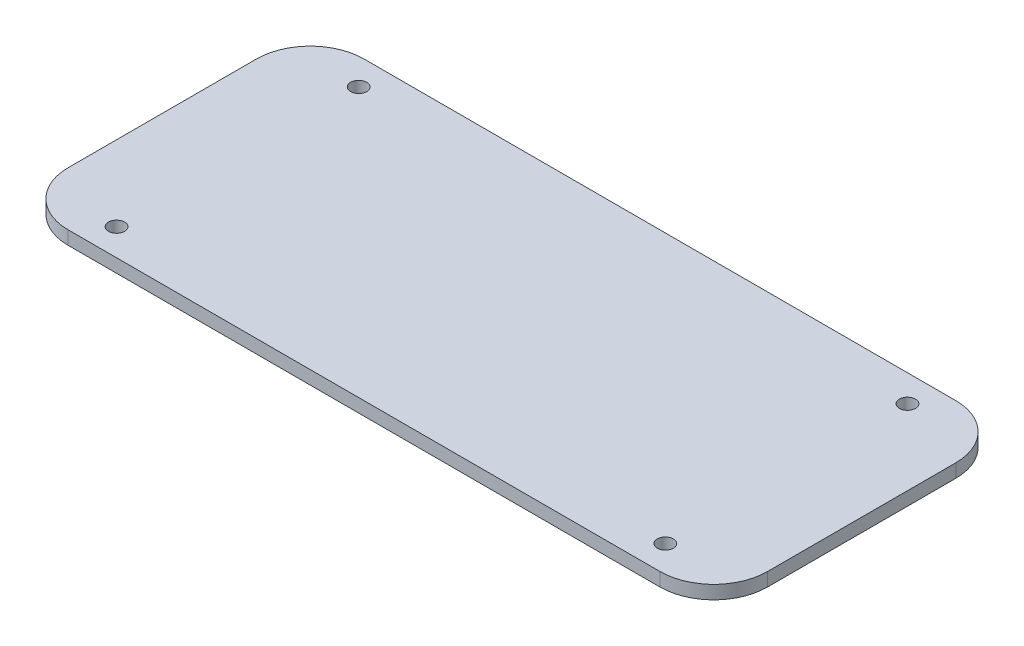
from build123d import *

# Parameters (mm, degrees)
SKETCH1_W               = 130
SKETCH1_H               = 55
BOSS_EXTRUDE1_DEPTH     = 2.5
FILLET1_R               = 10
CUT_EXTRUDE4_DEPTH      = 8
CUT_EXTRUDE4_DEPTH_BACK = 4.5
SKETCH2_R               = 1.5


with BuildPart() as part:
    # Sketch1 → Boss-Extrude1 (new body)
    with BuildSketch(Plane(origin=(0, 0, 0), x_dir=(1, 0, 0), z_dir=(0, 1, 0))):
        Rectangle(SKETCH1_W, SKETCH1_H)
    extrude(amount=BOSS_EXTRUDE1_DEPTH)

    # Fillet1
    fillet1_edges = [part.edges().sort_by_distance(p)[0] for p in [
        (65, 1.25, 27.5),
        (-65, 1.25, 27.5),
        (-65, 1.25, -27.5),
        (65, 1.25, -27.5),
    ]]
    fillet(fillet1_edges, radius=FILLET1_R)

    # Sketch2 → Cut-Extrude4 (cut, two sides: drawn at the far end of the back side and taken through both)
    with BuildSketch(Plane(origin=(0, 0, 0), x_dir=(1, 0, 0), z_dir=(0, 1, 0)).offset(-CUT_EXTRUDE4_DEPTH_BACK)):
        with Locations(Location((-51, 22.5, 0), (0, 0, 270))):
            Circle(SKETCH2_R)
        with Locations(Location((-51, -22.5, 0), (0, 0, 270))):
            Circle(SKETCH2_R)
        with Locations(Location((51, 22.5, 0), (0, 0, 270))):
            Circle(SKETCH2_R)
        with Locations(Location((51, -22.5, 0), (0, 0, 270))):
            Circle(SKETCH2_R)
    extrude(amount=CUT_EXTRUDE4_DEPTH + CUT_EXTRUDE4_DEPTH_BACK, mode=Mode.SUBTRACT)


solid = part.part
